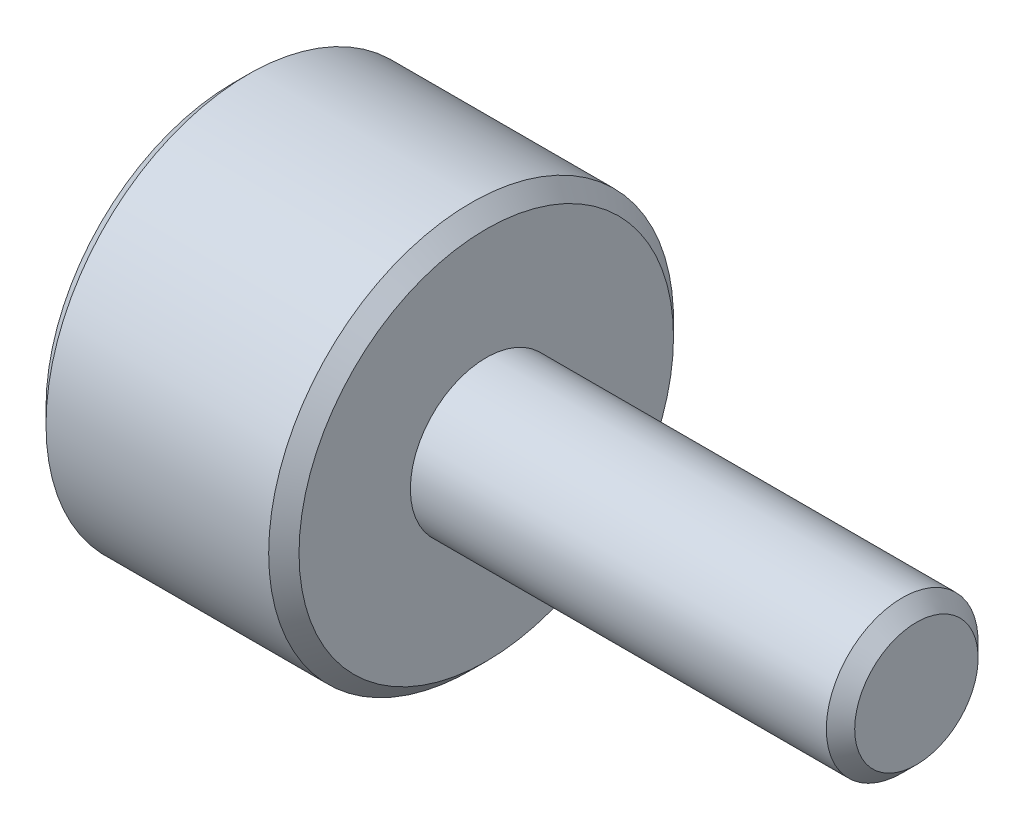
from build123d import *


with BuildPart() as part:
    # BodySke → Base-Revolve (revolve)
    with BuildSketch(Plane.XY, mode=Mode.PRIVATE) as base_revolve_sk:
        Polygon((13.2195, 1.5), (13.5, 1.2195), (13.5, 0), (0, 0), (0, 3.7), (0.3, 4), (4.7, 4), (5, 3.7), (5, 1.5), align=None)
    revolve(base_revolve_sk.sketch.rotate(Axis((-25.4, 0, 0), (1, 0, 0)), 90), axis=Axis((-25.4, 0, 0), (1, 0, 0)))


solid = part.part
